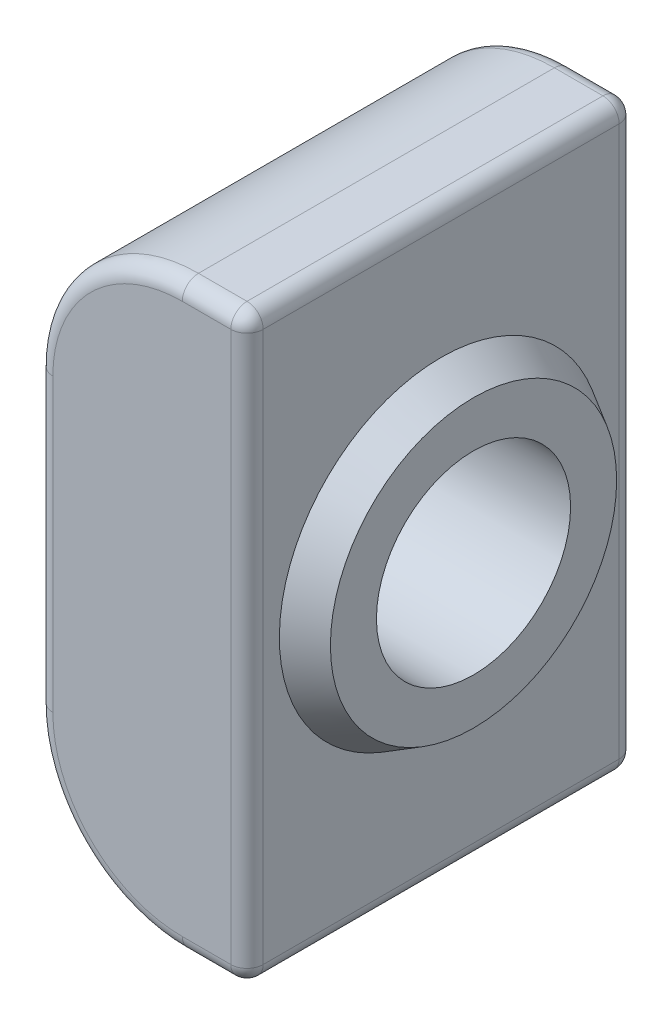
from build123d import *

# Parameters (mm, degrees)
BOSS_EXTRU_1_DEPTH      = 6
ESQUISSE2_R             = 5
BOSS_EXTRU_2_DEPTH      = 1
BOSS_EXTRU_2_TAPER      = 30
ESQUISSE3_R             = 3
ENL_V_MAT_EXTRU_1_DEPTH = 14.162446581
CONG_1_R                = 0.5


with BuildPart() as part:
    # Esquisse1 → Boss.-Extru.1 (new, symmetric)
    with BuildSketch(Plane.XY):
        with BuildLine():
            Line((0, 9), (-2, 9))
            ThreePointArc((-2, 9), (-5.181980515, 7.681980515), (-6.5, 4.5))
            Line((-6.5, 4.5), (-6.5, -4.5))
            ThreePointArc((-6.5, -4.5), (-5.181980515, -7.681980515), (-2, -9))
            Line((-2, -9), (0, -9))
            Line((0, -9), (0, 9))
        make_face()
    extrude(amount=BOSS_EXTRU_1_DEPTH, both=True)

    # Esquisse2 → Boss.-Extru.2 (add)
    with BuildSketch(Plane(origin=(0, 0, 0), x_dir=(0, 0, -1), z_dir=(1, 0, 0))):
        Circle(ESQUISSE2_R)
    extrude(amount=BOSS_EXTRU_2_DEPTH, taper=BOSS_EXTRU_2_TAPER)

    # Esquisse3 → Enl_v. mat.-Extru.1 (cut, through all)
    with BuildSketch(Plane(origin=(1, 0, 0), x_dir=(0, 0, -1), z_dir=(1, 0, 0))):
        with Locations(Location((0, 0, 0), (0, 0, 90))):
            Circle(ESQUISSE3_R)
    extrude(amount=-ENL_V_MAT_EXTRU_1_DEPTH, mode=Mode.SUBTRACT)

    # Cong_1
    cong_1_edges = [part.edges().sort_by_distance(p)[0] for p in [
        (0, -9, 0),
        (0, 9, 0),
        (-5.181980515, 7.681980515, 6),
        (-6.5, 0, 6),
        (-5.181980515, -7.681980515, 6),
        (-1, -9, 6),
        (0, 0, 6),
        (-1, -9, -6),
        (-5.181980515, -7.681980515, -6),
        (-6.5, 0, -6),
        (-5.181980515, 7.681980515, -6),
        (-1, 9, -6),
        (0, 0, -6),
        (-1, 9, 6),
    ]]
    fillet(cong_1_edges, radius=CONG_1_R)


solid = part.part
